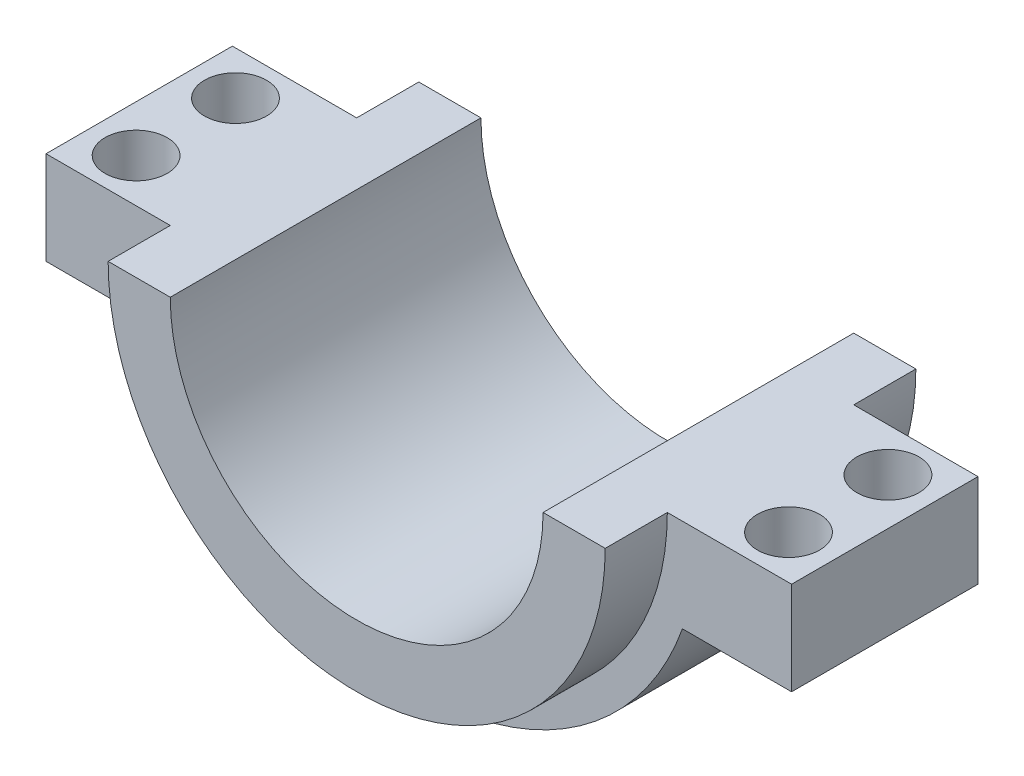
from build123d import *

# Parameters (mm, degrees)
DODANIE_WYCI_GNI_CIE1_DEPTH = 15
DODANIE_WYCI_GNI_CIE2_DEPTH = 25
SZKIC2_R                    = 5
WYTNIJ_WYCI_GNI_CIE1_DEPTH  = 80.056941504


with BuildPart() as part:
    # Szkic1 → Dodanie-wyci_gni_cie1 (new, symmetric)
    with BuildSketch(Plane.XY):
        with BuildLine():
            ThreePointArc((40, 0), (0, -40), (-40, 0))
            Line((-40, 0), (-60, 0))
            Line((-60, 0), (-60, -15))
            Line((-60, -15), (-42.426406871, -15))
            ThreePointArc((-42.426406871, -15), (0, -45), (42.426406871, -15))
            Line((42.426406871, -15), (60, -15))
            Line((60, -15), (60, 0))
            Line((60, 0), (40, 0))
        make_face()
    extrude(amount=DODANIE_WYCI_GNI_CIE1_DEPTH, both=True)

    # Szkic1_3 → Dodanie-wyci_gni_cie2 (add, symmetric)
    with BuildSketch(Plane.XY):
        with BuildLine():
            ThreePointArc((30, 0), (0, -30), (-30, 0))
            Line((-30, 0), (-40, 0))
            ThreePointArc((-40, 0), (0, -40), (40, 0))
            Line((40, 0), (30, 0))
        make_face()
    extrude(amount=DODANIE_WYCI_GNI_CIE2_DEPTH, both=True)

    # Szkic2 → Wytnij-wyci_gni_cie1 (cut, through all)
    with BuildSketch(Plane(origin=(0, 0, 0), x_dir=(1, 0, 0), z_dir=(0, 1, 0))):
        with Locations(Location((-52.5, 8, 0), (0, 0, 180))):
            Circle(SZKIC2_R)
        with Locations(Location((-52.5, -8, 0), (0, 0, 180))):
            Circle(SZKIC2_R)
    wytnij_wyci_gni_cie1 = extrude(amount=-WYTNIJ_WYCI_GNI_CIE1_DEPTH, mode=Mode.SUBTRACT)

    # Lustro1: Wytnij-wyci_gni_cie1 across plane
    add(wytnij_wyci_gni_cie1.mirror(Plane(origin=(0, 0, 0), x_dir=(0, 0, 1), z_dir=(1, 0, 0))), mode=Mode.SUBTRACT)


solid = part.part
